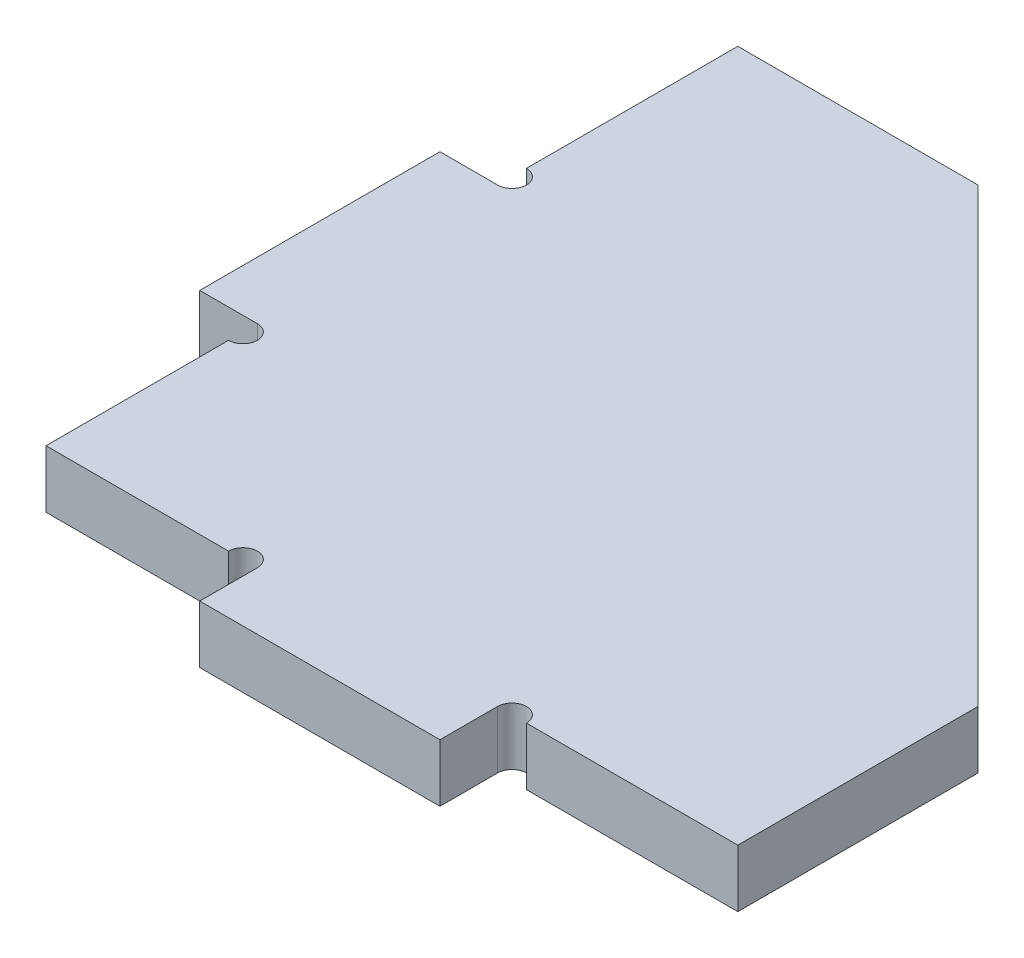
ISO-10303-21;
HEADER;
FILE_DESCRIPTION(('STEP AP214'),'2;1');
FILE_NAME('part.step','',(''),(''),'','','');
FILE_SCHEMA(('AUTOMOTIVE_DESIGN { 1 0 10303 214 1 1 1 1 }'));
ENDSEC;
DATA;
#1=APPLICATION_CONTEXT('core data for automotive mechanical design processes');
#2=APPLICATION_PROTOCOL_DEFINITION('international standard','automotive_design',2000,#1);
#3=PRODUCT_CONTEXT('',#1,'mechanical');
#4=PRODUCT('Part','Part','',(#3));
#5=PRODUCT_RELATED_PRODUCT_CATEGORY('part','',(#4));
#6=PRODUCT_DEFINITION_FORMATION('','',#4);
#7=PRODUCT_DEFINITION_CONTEXT('part definition',#1,'design');
#8=PRODUCT_DEFINITION('design','',#6,#7);
#9=PRODUCT_DEFINITION_SHAPE('','',#8);
#10=(LENGTH_UNIT() NAMED_UNIT(*) SI_UNIT(.MILLI.,.METRE.));
#11=(NAMED_UNIT(*) PLANE_ANGLE_UNIT() SI_UNIT($,.RADIAN.));
#12=(NAMED_UNIT(*) SI_UNIT($,.STERADIAN.) SOLID_ANGLE_UNIT());
#13=UNCERTAINTY_MEASURE_WITH_UNIT(LENGTH_MEASURE(1.E-05),#10,'distance_accuracy_value','');
#14=(GEOMETRIC_REPRESENTATION_CONTEXT(3) GLOBAL_UNCERTAINTY_ASSIGNED_CONTEXT((#13)) GLOBAL_UNIT_ASSIGNED_CONTEXT((#10,
#11,#12)) REPRESENTATION_CONTEXT('',''));
#15=CARTESIAN_POINT('',(0.,0.,0.));
#16=DIRECTION('',(0.,0.,1.));
#17=DIRECTION('',(1.,0.,0.));
#18=AXIS2_PLACEMENT_3D('',#15,#16,#17);
#19=CARTESIAN_POINT('',(0.,12.,-144.));
#20=DIRECTION('',(0.,0.,1.));
#21=DIRECTION('',(1.,0.,0.));
#22=AXIS2_PLACEMENT_3D('',#19,#20,#21);
#23=PLANE('',#22);
#24=DIRECTION('',(-1.,0.,0.));
#25=VECTOR('',#24,1.);
#26=CARTESIAN_POINT('',(0.,0.,-144.));
#27=LINE('',#26,#25);
#28=CARTESIAN_POINT('',(50.,0.,-144.));
#29=VERTEX_POINT('',#28);
#30=CARTESIAN_POINT('',(0.,0.,-144.));
#31=VERTEX_POINT('',#30);
#32=EDGE_CURVE('E187',#29,#31,#27,.T.);
#33=ORIENTED_EDGE('',*,*,#32,.T.);
#34=DIRECTION('',(0.,-1.,0.));
#35=VECTOR('',#34,1.);
#36=CARTESIAN_POINT('',(0.,12.,-144.));
#37=LINE('',#36,#35);
#38=CARTESIAN_POINT('',(0.,12.,-144.));
#39=VERTEX_POINT('',#38);
#40=EDGE_CURVE('E11',#39,#31,#37,.T.);
#41=ORIENTED_EDGE('',*,*,#40,.F.);
#42=DIRECTION('',(-1.,0.,0.));
#43=VECTOR('',#42,1.);
#44=CARTESIAN_POINT('',(0.,12.,-144.));
#45=LINE('',#44,#43);
#46=CARTESIAN_POINT('',(50.,12.,-144.));
#47=VERTEX_POINT('',#46);
#48=EDGE_CURVE('E219',#47,#39,#45,.T.);
#49=ORIENTED_EDGE('',*,*,#48,.F.);
#50=DIRECTION('',(0.,-1.,0.));
#51=VECTOR('',#50,1.);
#52=CARTESIAN_POINT('',(50.,12.,-144.));
#53=LINE('',#52,#51);
#54=EDGE_CURVE('E183',#47,#29,#53,.T.);
#55=ORIENTED_EDGE('',*,*,#54,.T.);
#56=EDGE_LOOP('',(#33,#41,#49,#55));
#57=FACE_BOUND('',#56,.T.);
#58=ADVANCED_FACE('F37',(#57),#23,.F.);
#59=CARTESIAN_POINT('',(0.,12.,-144.));
#60=DIRECTION('',(1.,0.,0.));
#61=DIRECTION('',(0.,0.,-1.));
#62=AXIS2_PLACEMENT_3D('',#59,#60,#61);
#63=PLANE('',#62);
#64=DIRECTION('',(0.,0.,1.));
#65=VECTOR('',#64,1.);
#66=CARTESIAN_POINT('',(0.,0.,-144.));
#67=LINE('',#66,#65);
#68=CARTESIAN_POINT('',(0.,0.,-100.));
#69=VERTEX_POINT('',#68);
#70=EDGE_CURVE('E190',#31,#69,#67,.T.);
#71=ORIENTED_EDGE('',*,*,#70,.T.);
#72=DIRECTION('',(0.,-1.,0.));
#73=VECTOR('',#72,1.);
#74=CARTESIAN_POINT('',(0.,12.,-100.));
#75=LINE('',#74,#73);
#76=CARTESIAN_POINT('',(0.,12.,-100.));
#77=VERTEX_POINT('',#76);
#78=EDGE_CURVE('E45',#77,#69,#75,.T.);
#79=ORIENTED_EDGE('',*,*,#78,.F.);
#80=DIRECTION('',(0.,0.,1.));
#81=VECTOR('',#80,1.);
#82=CARTESIAN_POINT('',(0.,12.,-144.));
#83=LINE('',#82,#81);
#84=EDGE_CURVE('E123',#39,#77,#83,.T.);
#85=ORIENTED_EDGE('',*,*,#84,.F.);
#86=ORIENTED_EDGE('',*,*,#40,.T.);
#87=EDGE_LOOP('',(#71,#79,#85,#86));
#88=FACE_BOUND('',#87,.T.);
#89=ADVANCED_FACE('F322',(#88),#63,.F.);
#90=CARTESIAN_POINT('',(0.,12.,-97.));
#91=DIRECTION('',(0.,-1.,0.));
#92=DIRECTION('',(0.,0.,-1.));
#93=AXIS2_PLACEMENT_3D('',#90,#91,#92);
#94=CYLINDRICAL_SURFACE('',#93,3.);
#95=CARTESIAN_POINT('',(0.,0.,-97.));
#96=DIRECTION('',(0.,-1.,0.));
#97=DIRECTION('',(0.,0.,1.));
#98=AXIS2_PLACEMENT_3D('',#95,#96,#97);
#99=CIRCLE('',#98,3.);
#100=CARTESIAN_POINT('',(0.,0.,-94.));
#101=VERTEX_POINT('',#100);
#102=EDGE_CURVE('E192',#69,#101,#99,.T.);
#103=ORIENTED_EDGE('',*,*,#102,.T.);
#104=DIRECTION('',(0.,-1.,0.));
#105=VECTOR('',#104,1.);
#106=CARTESIAN_POINT('',(0.,12.,-94.));
#107=LINE('',#106,#105);
#108=CARTESIAN_POINT('',(0.,12.,-94.));
#109=VERTEX_POINT('',#108);
#110=EDGE_CURVE('E253',#109,#101,#107,.T.);
#111=ORIENTED_EDGE('',*,*,#110,.F.);
#112=CARTESIAN_POINT('',(0.,12.,-97.));
#113=DIRECTION('',(0.,-1.,0.));
#114=DIRECTION('',(0.,0.,1.));
#115=AXIS2_PLACEMENT_3D('',#112,#113,#114);
#116=CIRCLE('',#115,3.);
#117=EDGE_CURVE('E261',#77,#109,#116,.T.);
#118=ORIENTED_EDGE('',*,*,#117,.F.);
#119=ORIENTED_EDGE('',*,*,#78,.T.);
#120=EDGE_LOOP('',(#103,#111,#118,#119));
#121=FACE_BOUND('',#120,.T.);
#122=ADVANCED_FACE('F259',(#121),#94,.F.);
#123=CARTESIAN_POINT('',(0.,12.,-94.));
#124=DIRECTION('',(0.,0.,1.));
#125=DIRECTION('',(1.,0.,0.));
#126=AXIS2_PLACEMENT_3D('',#123,#124,#125);
#127=PLANE('',#126);
#128=DIRECTION('',(-1.,0.,0.));
#129=VECTOR('',#128,1.);
#130=CARTESIAN_POINT('',(0.,0.,-94.));
#131=LINE('',#130,#129);
#132=CARTESIAN_POINT('',(-12.,0.,-94.));
#133=VERTEX_POINT('',#132);
#134=EDGE_CURVE('E194',#101,#133,#131,.T.);
#135=ORIENTED_EDGE('',*,*,#134,.T.);
#136=DIRECTION('',(0.,-1.,0.));
#137=VECTOR('',#136,1.);
#138=CARTESIAN_POINT('',(-12.,12.,-94.));
#139=LINE('',#138,#137);
#140=CARTESIAN_POINT('',(-12.,12.,-94.));
#141=VERTEX_POINT('',#140);
#142=EDGE_CURVE('E250',#141,#133,#139,.T.);
#143=ORIENTED_EDGE('',*,*,#142,.F.);
#144=DIRECTION('',(-1.,0.,0.));
#145=VECTOR('',#144,1.);
#146=CARTESIAN_POINT('',(0.,12.,-94.));
#147=LINE('',#146,#145);
#148=EDGE_CURVE('E279',#109,#141,#147,.T.);
#149=ORIENTED_EDGE('',*,*,#148,.F.);
#150=ORIENTED_EDGE('',*,*,#110,.T.);
#151=EDGE_LOOP('',(#135,#143,#149,#150));
#152=FACE_BOUND('',#151,.T.);
#153=ADVANCED_FACE('F270',(#152),#127,.F.);
#154=CARTESIAN_POINT('',(-12.,12.,-94.));
#155=DIRECTION('',(1.,0.,0.));
#156=DIRECTION('',(0.,0.,-1.));
#157=AXIS2_PLACEMENT_3D('',#154,#155,#156);
#158=PLANE('',#157);
#159=DIRECTION('',(0.,0.,1.));
#160=VECTOR('',#159,1.);
#161=CARTESIAN_POINT('',(-12.,0.,-94.));
#162=LINE('',#161,#160);
#163=CARTESIAN_POINT('',(-12.,0.,-44.));
#164=VERTEX_POINT('',#163);
#165=EDGE_CURVE('E196',#133,#164,#162,.T.);
#166=ORIENTED_EDGE('',*,*,#165,.T.);
#167=DIRECTION('',(0.,-1.,0.));
#168=VECTOR('',#167,1.);
#169=CARTESIAN_POINT('',(-12.,12.,-44.));
#170=LINE('',#169,#168);
#171=CARTESIAN_POINT('',(-12.,12.,-44.));
#172=VERTEX_POINT('',#171);
#173=EDGE_CURVE('E247',#172,#164,#170,.T.);
#174=ORIENTED_EDGE('',*,*,#173,.F.);
#175=DIRECTION('',(0.,0.,1.));
#176=VECTOR('',#175,1.);
#177=CARTESIAN_POINT('',(-12.,12.,-94.));
#178=LINE('',#177,#176);
#179=EDGE_CURVE('E276',#141,#172,#178,.T.);
#180=ORIENTED_EDGE('',*,*,#179,.F.);
#181=ORIENTED_EDGE('',*,*,#142,.T.);
#182=EDGE_LOOP('',(#166,#174,#180,#181));
#183=FACE_BOUND('',#182,.T.);
#184=ADVANCED_FACE('F274',(#183),#158,.F.);
#185=CARTESIAN_POINT('',(0.,12.,-44.));
#186=DIRECTION('',(0.,0.,-1.));
#187=DIRECTION('',(-1.,0.,0.));
#188=AXIS2_PLACEMENT_3D('',#185,#186,#187);
#189=PLANE('',#188);
#190=DIRECTION('',(1.,0.,0.));
#191=VECTOR('',#190,1.);
#192=CARTESIAN_POINT('',(0.,0.,-44.));
#193=LINE('',#192,#191);
#194=CARTESIAN_POINT('',(0.,0.,-44.));
#195=VERTEX_POINT('',#194);
#196=EDGE_CURVE('E198',#164,#195,#193,.T.);
#197=ORIENTED_EDGE('',*,*,#196,.T.);
#198=DIRECTION('',(0.,-1.,0.));
#199=VECTOR('',#198,1.);
#200=CARTESIAN_POINT('',(0.,12.,-44.));
#201=LINE('',#200,#199);
#202=CARTESIAN_POINT('',(0.,12.,-44.));
#203=VERTEX_POINT('',#202);
#204=EDGE_CURVE('E244',#203,#195,#201,.T.);
#205=ORIENTED_EDGE('',*,*,#204,.F.);
#206=DIRECTION('',(1.,0.,0.));
#207=VECTOR('',#206,1.);
#208=CARTESIAN_POINT('',(0.,12.,-44.));
#209=LINE('',#208,#207);
#210=EDGE_CURVE('E278',#172,#203,#209,.T.);
#211=ORIENTED_EDGE('',*,*,#210,.F.);
#212=ORIENTED_EDGE('',*,*,#173,.T.);
#213=EDGE_LOOP('',(#197,#205,#211,#212));
#214=FACE_BOUND('',#213,.T.);
#215=ADVANCED_FACE('F335',(#214),#189,.F.);
#216=CARTESIAN_POINT('',(0.,12.,-41.));
#217=DIRECTION('',(0.,-1.,0.));
#218=DIRECTION('',(0.,0.,-1.));
#219=AXIS2_PLACEMENT_3D('',#216,#217,#218);
#220=CYLINDRICAL_SURFACE('',#219,3.);
#221=CARTESIAN_POINT('',(0.,0.,-41.));
#222=DIRECTION('',(0.,-1.,0.));
#223=DIRECTION('',(0.,0.,1.));
#224=AXIS2_PLACEMENT_3D('',#221,#222,#223);
#225=CIRCLE('',#224,3.);
#226=CARTESIAN_POINT('',(0.,0.,-38.));
#227=VERTEX_POINT('',#226);
#228=EDGE_CURVE('E200',#195,#227,#225,.T.);
#229=ORIENTED_EDGE('',*,*,#228,.T.);
#230=DIRECTION('',(0.,-1.,0.));
#231=VECTOR('',#230,1.);
#232=CARTESIAN_POINT('',(0.,12.,-38.));
#233=LINE('',#232,#231);
#234=CARTESIAN_POINT('',(0.,12.,-38.));
#235=VERTEX_POINT('',#234);
#236=EDGE_CURVE('E241',#235,#227,#233,.T.);
#237=ORIENTED_EDGE('',*,*,#236,.F.);
#238=CARTESIAN_POINT('',(0.,12.,-41.));
#239=DIRECTION('',(0.,-1.,0.));
#240=DIRECTION('',(0.,0.,1.));
#241=AXIS2_PLACEMENT_3D('',#238,#239,#240);
#242=CIRCLE('',#241,3.);
#243=EDGE_CURVE('E281',#203,#235,#242,.T.);
#244=ORIENTED_EDGE('',*,*,#243,.F.);
#245=ORIENTED_EDGE('',*,*,#204,.T.);
#246=EDGE_LOOP('',(#229,#237,#244,#245));
#247=FACE_BOUND('',#246,.T.);
#248=ADVANCED_FACE('F338',(#247),#220,.F.);
#249=CARTESIAN_POINT('',(0.,12.,-38.));
#250=DIRECTION('',(1.,0.,0.));
#251=DIRECTION('',(0.,0.,-1.));
#252=AXIS2_PLACEMENT_3D('',#249,#250,#251);
#253=PLANE('',#252);
#254=DIRECTION('',(0.,0.,1.));
#255=VECTOR('',#254,1.);
#256=CARTESIAN_POINT('',(0.,0.,-38.));
#257=LINE('',#256,#255);
#258=CARTESIAN_POINT('',(0.,0.,0.));
#259=VERTEX_POINT('',#258);
#260=EDGE_CURVE('E202',#227,#259,#257,.T.);
#261=ORIENTED_EDGE('',*,*,#260,.T.);
#262=DIRECTION('',(0.,-1.,0.));
#263=VECTOR('',#262,1.);
#264=CARTESIAN_POINT('',(0.,12.,0.));
#265=LINE('',#264,#263);
#266=CARTESIAN_POINT('',(0.,12.,0.));
#267=VERTEX_POINT('',#266);
#268=EDGE_CURVE('E238',#267,#259,#265,.T.);
#269=ORIENTED_EDGE('',*,*,#268,.F.);
#270=DIRECTION('',(0.,0.,1.));
#271=VECTOR('',#270,1.);
#272=CARTESIAN_POINT('',(0.,12.,-38.));
#273=LINE('',#272,#271);
#274=EDGE_CURVE('E287',#235,#267,#273,.T.);
#275=ORIENTED_EDGE('',*,*,#274,.F.);
#276=ORIENTED_EDGE('',*,*,#236,.T.);
#277=EDGE_LOOP('',(#261,#269,#275,#276));
#278=FACE_BOUND('',#277,.T.);
#279=ADVANCED_FACE('F342',(#278),#253,.F.);
#280=CARTESIAN_POINT('',(0.,12.,0.));
#281=DIRECTION('',(0.,0.,-1.));
#282=DIRECTION('',(-1.,0.,0.));
#283=AXIS2_PLACEMENT_3D('',#280,#281,#282);
#284=PLANE('',#283);
#285=DIRECTION('',(1.,0.,0.));
#286=VECTOR('',#285,1.);
#287=CARTESIAN_POINT('',(0.,0.,0.));
#288=LINE('',#287,#286);
#289=CARTESIAN_POINT('',(38.,0.,0.));
#290=VERTEX_POINT('',#289);
#291=EDGE_CURVE('E204',#259,#290,#288,.T.);
#292=ORIENTED_EDGE('',*,*,#291,.T.);
#293=DIRECTION('',(0.,-1.,0.));
#294=VECTOR('',#293,1.);
#295=CARTESIAN_POINT('',(38.,12.,0.));
#296=LINE('',#295,#294);
#297=CARTESIAN_POINT('',(38.,12.,0.));
#298=VERTEX_POINT('',#297);
#299=EDGE_CURVE('E235',#298,#290,#296,.T.);
#300=ORIENTED_EDGE('',*,*,#299,.F.);
#301=DIRECTION('',(1.,0.,0.));
#302=VECTOR('',#301,1.);
#303=CARTESIAN_POINT('',(0.,12.,0.));
#304=LINE('',#303,#302);
#305=EDGE_CURVE('E289',#267,#298,#304,.T.);
#306=ORIENTED_EDGE('',*,*,#305,.F.);
#307=ORIENTED_EDGE('',*,*,#268,.T.);
#308=EDGE_LOOP('',(#292,#300,#306,#307));
#309=FACE_BOUND('',#308,.T.);
#310=ADVANCED_FACE('F346',(#309),#284,.F.);
#311=CARTESIAN_POINT('',(41.,12.,0.));
#312=DIRECTION('',(0.,-1.,0.));
#313=DIRECTION('',(0.,0.,-1.));
#314=AXIS2_PLACEMENT_3D('',#311,#312,#313);
#315=CYLINDRICAL_SURFACE('',#314,3.00000000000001);
#316=CARTESIAN_POINT('',(41.,0.,0.));
#317=DIRECTION('',(0.,-1.,0.));
#318=DIRECTION('',(0.,0.,1.));
#319=AXIS2_PLACEMENT_3D('',#316,#317,#318);
#320=CIRCLE('',#319,3.00000000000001);
#321=CARTESIAN_POINT('',(44.,0.,0.));
#322=VERTEX_POINT('',#321);
#323=EDGE_CURVE('E206',#290,#322,#320,.T.);
#324=ORIENTED_EDGE('',*,*,#323,.T.);
#325=DIRECTION('',(0.,-1.,0.));
#326=VECTOR('',#325,1.);
#327=CARTESIAN_POINT('',(44.,12.,0.));
#328=LINE('',#327,#326);
#329=CARTESIAN_POINT('',(44.,12.,0.));
#330=VERTEX_POINT('',#329);
#331=EDGE_CURVE('E232',#330,#322,#328,.T.);
#332=ORIENTED_EDGE('',*,*,#331,.F.);
#333=CARTESIAN_POINT('',(41.,12.,0.));
#334=DIRECTION('',(0.,-1.,0.));
#335=DIRECTION('',(0.,0.,1.));
#336=AXIS2_PLACEMENT_3D('',#333,#334,#335);
#337=CIRCLE('',#336,3.00000000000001);
#338=EDGE_CURVE('E291',#298,#330,#337,.T.);
#339=ORIENTED_EDGE('',*,*,#338,.F.);
#340=ORIENTED_EDGE('',*,*,#299,.T.);
#341=EDGE_LOOP('',(#324,#332,#339,#340));
#342=FACE_BOUND('',#341,.T.);
#343=ADVANCED_FACE('F350',(#342),#315,.F.);
#344=CARTESIAN_POINT('',(44.,12.,0.));
#345=DIRECTION('',(1.,0.,0.));
#346=DIRECTION('',(0.,0.,-1.));
#347=AXIS2_PLACEMENT_3D('',#344,#345,#346);
#348=PLANE('',#347);
#349=DIRECTION('',(0.,0.,1.));
#350=VECTOR('',#349,1.);
#351=CARTESIAN_POINT('',(44.,0.,0.));
#352=LINE('',#351,#350);
#353=CARTESIAN_POINT('',(44.,0.,12.));
#354=VERTEX_POINT('',#353);
#355=EDGE_CURVE('E208',#322,#354,#352,.T.);
#356=ORIENTED_EDGE('',*,*,#355,.T.);
#357=DIRECTION('',(0.,-1.,0.));
#358=VECTOR('',#357,1.);
#359=CARTESIAN_POINT('',(44.,12.,12.));
#360=LINE('',#359,#358);
#361=CARTESIAN_POINT('',(44.,12.,12.));
#362=VERTEX_POINT('',#361);
#363=EDGE_CURVE('E229',#362,#354,#360,.T.);
#364=ORIENTED_EDGE('',*,*,#363,.F.);
#365=DIRECTION('',(0.,0.,1.));
#366=VECTOR('',#365,1.);
#367=CARTESIAN_POINT('',(44.,12.,0.));
#368=LINE('',#367,#366);
#369=EDGE_CURVE('E293',#330,#362,#368,.T.);
#370=ORIENTED_EDGE('',*,*,#369,.F.);
#371=ORIENTED_EDGE('',*,*,#331,.T.);
#372=EDGE_LOOP('',(#356,#364,#370,#371));
#373=FACE_BOUND('',#372,.T.);
#374=ADVANCED_FACE('F354',(#373),#348,.F.);
#375=CARTESIAN_POINT('',(44.,12.,12.));
#376=DIRECTION('',(0.,0.,-1.));
#377=DIRECTION('',(-1.,0.,0.));
#378=AXIS2_PLACEMENT_3D('',#375,#376,#377);
#379=PLANE('',#378);
#380=DIRECTION('',(1.,0.,0.));
#381=VECTOR('',#380,1.);
#382=CARTESIAN_POINT('',(44.,0.,12.));
#383=LINE('',#382,#381);
#384=CARTESIAN_POINT('',(94.,0.,12.));
#385=VERTEX_POINT('',#384);
#386=EDGE_CURVE('E210',#354,#385,#383,.T.);
#387=ORIENTED_EDGE('',*,*,#386,.T.);
#388=DIRECTION('',(0.,-1.,0.));
#389=VECTOR('',#388,1.);
#390=CARTESIAN_POINT('',(94.,12.,12.));
#391=LINE('',#390,#389);
#392=CARTESIAN_POINT('',(94.,12.,12.));
#393=VERTEX_POINT('',#392);
#394=EDGE_CURVE('E226',#393,#385,#391,.T.);
#395=ORIENTED_EDGE('',*,*,#394,.F.);
#396=DIRECTION('',(1.,0.,0.));
#397=VECTOR('',#396,1.);
#398=CARTESIAN_POINT('',(44.,12.,12.));
#399=LINE('',#398,#397);
#400=EDGE_CURVE('E295',#362,#393,#399,.T.);
#401=ORIENTED_EDGE('',*,*,#400,.F.);
#402=ORIENTED_EDGE('',*,*,#363,.T.);
#403=EDGE_LOOP('',(#387,#395,#401,#402));
#404=FACE_BOUND('',#403,.T.);
#405=ADVANCED_FACE('F358',(#404),#379,.F.);
#406=CARTESIAN_POINT('',(94.,12.,0.));
#407=DIRECTION('',(-1.,0.,0.));
#408=DIRECTION('',(0.,0.,1.));
#409=AXIS2_PLACEMENT_3D('',#406,#407,#408);
#410=PLANE('',#409);
#411=DIRECTION('',(0.,0.,-1.));
#412=VECTOR('',#411,1.);
#413=CARTESIAN_POINT('',(94.,0.,0.));
#414=LINE('',#413,#412);
#415=CARTESIAN_POINT('',(94.,0.,0.));
#416=VERTEX_POINT('',#415);
#417=EDGE_CURVE('E212',#385,#416,#414,.T.);
#418=ORIENTED_EDGE('',*,*,#417,.T.);
#419=DIRECTION('',(0.,-1.,0.));
#420=VECTOR('',#419,1.);
#421=CARTESIAN_POINT('',(94.,12.,0.));
#422=LINE('',#421,#420);
#423=CARTESIAN_POINT('',(94.,12.,0.));
#424=VERTEX_POINT('',#423);
#425=EDGE_CURVE('E223',#424,#416,#422,.T.);
#426=ORIENTED_EDGE('',*,*,#425,.F.);
#427=DIRECTION('',(0.,0.,-1.));
#428=VECTOR('',#427,1.);
#429=CARTESIAN_POINT('',(94.,12.,0.));
#430=LINE('',#429,#428);
#431=EDGE_CURVE('E297',#393,#424,#430,.T.);
#432=ORIENTED_EDGE('',*,*,#431,.F.);
#433=ORIENTED_EDGE('',*,*,#394,.T.);
#434=EDGE_LOOP('',(#418,#426,#432,#433));
#435=FACE_BOUND('',#434,.T.);
#436=ADVANCED_FACE('F303',(#435),#410,.F.);
#437=CARTESIAN_POINT('',(97.,12.,0.));
#438=DIRECTION('',(0.,-1.,0.));
#439=DIRECTION('',(0.,0.,-1.));
#440=AXIS2_PLACEMENT_3D('',#437,#438,#439);
#441=CYLINDRICAL_SURFACE('',#440,2.99999999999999);
#442=CARTESIAN_POINT('',(97.,0.,0.));
#443=DIRECTION('',(0.,-1.,0.));
#444=DIRECTION('',(0.,0.,1.));
#445=AXIS2_PLACEMENT_3D('',#442,#443,#444);
#446=CIRCLE('',#445,2.99999999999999);
#447=CARTESIAN_POINT('',(100.,0.,0.));
#448=VERTEX_POINT('',#447);
#449=EDGE_CURVE('E214',#416,#448,#446,.T.);
#450=ORIENTED_EDGE('',*,*,#449,.T.);
#451=DIRECTION('',(0.,-1.,0.));
#452=VECTOR('',#451,1.);
#453=CARTESIAN_POINT('',(100.,12.,0.));
#454=LINE('',#453,#452);
#455=CARTESIAN_POINT('',(100.,12.,0.));
#456=VERTEX_POINT('',#455);
#457=EDGE_CURVE('E178',#456,#448,#454,.T.);
#458=ORIENTED_EDGE('',*,*,#457,.F.);
#459=CARTESIAN_POINT('',(97.,12.,0.));
#460=DIRECTION('',(0.,-1.,0.));
#461=DIRECTION('',(0.,0.,1.));
#462=AXIS2_PLACEMENT_3D('',#459,#460,#461);
#463=CIRCLE('',#462,2.99999999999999);
#464=EDGE_CURVE('E169',#424,#456,#463,.T.);
#465=ORIENTED_EDGE('',*,*,#464,.F.);
#466=ORIENTED_EDGE('',*,*,#425,.T.);
#467=EDGE_LOOP('',(#450,#458,#465,#466));
#468=FACE_BOUND('',#467,.T.);
#469=ADVANCED_FACE('F307',(#468),#441,.F.);
#470=CARTESIAN_POINT('',(100.,12.,0.));
#471=DIRECTION('',(0.,0.,-1.));
#472=DIRECTION('',(-1.,0.,0.));
#473=AXIS2_PLACEMENT_3D('',#470,#471,#472);
#474=PLANE('',#473);
#475=DIRECTION('',(1.,0.,0.));
#476=VECTOR('',#475,1.);
#477=CARTESIAN_POINT('',(100.,0.,0.));
#478=LINE('',#477,#476);
#479=CARTESIAN_POINT('',(144.,0.,0.));
#480=VERTEX_POINT('',#479);
#481=EDGE_CURVE('E177',#448,#480,#478,.T.);
#482=ORIENTED_EDGE('',*,*,#481,.T.);
#483=DIRECTION('',(0.,-1.,0.));
#484=VECTOR('',#483,1.);
#485=CARTESIAN_POINT('',(144.,12.,0.));
#486=LINE('',#485,#484);
#487=CARTESIAN_POINT('',(144.,12.,0.));
#488=VERTEX_POINT('',#487);
#489=EDGE_CURVE('E174',#488,#480,#486,.T.);
#490=ORIENTED_EDGE('',*,*,#489,.F.);
#491=DIRECTION('',(1.,0.,0.));
#492=VECTOR('',#491,1.);
#493=CARTESIAN_POINT('',(100.,12.,0.));
#494=LINE('',#493,#492);
#495=EDGE_CURVE('E163',#456,#488,#494,.T.);
#496=ORIENTED_EDGE('',*,*,#495,.F.);
#497=ORIENTED_EDGE('',*,*,#457,.T.);
#498=EDGE_LOOP('',(#482,#490,#496,#497));
#499=FACE_BOUND('',#498,.T.);
#500=ADVANCED_FACE('F175',(#499),#474,.F.);
#501=CARTESIAN_POINT('',(144.,12.,-50.));
#502=DIRECTION('',(-1.,0.,0.));
#503=DIRECTION('',(0.,0.,1.));
#504=AXIS2_PLACEMENT_3D('',#501,#502,#503);
#505=PLANE('',#504);
#506=DIRECTION('',(0.,0.,-1.));
#507=VECTOR('',#506,1.);
#508=CARTESIAN_POINT('',(144.,0.,-50.));
#509=LINE('',#508,#507);
#510=CARTESIAN_POINT('',(144.,0.,-50.));
#511=VERTEX_POINT('',#510);
#512=EDGE_CURVE('E109',#480,#511,#509,.T.);
#513=ORIENTED_EDGE('',*,*,#512,.T.);
#514=DIRECTION('',(0.,-1.,0.));
#515=VECTOR('',#514,1.);
#516=CARTESIAN_POINT('',(144.,12.,-50.));
#517=LINE('',#516,#515);
#518=CARTESIAN_POINT('',(144.,12.,-50.));
#519=VERTEX_POINT('',#518);
#520=EDGE_CURVE('E179',#519,#511,#517,.T.);
#521=ORIENTED_EDGE('',*,*,#520,.F.);
#522=DIRECTION('',(0.,0.,-1.));
#523=VECTOR('',#522,1.);
#524=CARTESIAN_POINT('',(144.,12.,-50.));
#525=LINE('',#524,#523);
#526=EDGE_CURVE('E167',#488,#519,#525,.T.);
#527=ORIENTED_EDGE('',*,*,#526,.F.);
#528=ORIENTED_EDGE('',*,*,#489,.T.);
#529=EDGE_LOOP('',(#513,#521,#527,#528));
#530=FACE_BOUND('',#529,.T.);
#531=ADVANCED_FACE('F181',(#530),#505,.F.);
#532=CARTESIAN_POINT('',(50.,12.,-144.));
#533=DIRECTION('',(-0.707106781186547,0.,0.707106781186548));
#534=DIRECTION('',(0.707106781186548,0.,0.707106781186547));
#535=AXIS2_PLACEMENT_3D('',#532,#533,#534);
#536=PLANE('',#535);
#537=DIRECTION('',(-0.707106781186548,0.,-0.707106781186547));
#538=VECTOR('',#537,1.);
#539=CARTESIAN_POINT('',(50.,0.,-144.));
#540=LINE('',#539,#538);
#541=EDGE_CURVE('E115',#511,#29,#540,.T.);
#542=ORIENTED_EDGE('',*,*,#541,.T.);
#543=ORIENTED_EDGE('',*,*,#54,.F.);
#544=DIRECTION('',(-0.707106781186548,0.,-0.707106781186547));
#545=VECTOR('',#544,1.);
#546=CARTESIAN_POINT('',(50.,12.,-144.));
#547=LINE('',#546,#545);
#548=EDGE_CURVE('E53',#519,#47,#547,.T.);
#549=ORIENTED_EDGE('',*,*,#548,.F.);
#550=ORIENTED_EDGE('',*,*,#520,.T.);
#551=EDGE_LOOP('',(#542,#543,#549,#550));
#552=FACE_BOUND('',#551,.T.);
#553=ADVANCED_FACE('F311',(#552),#536,.F.);
#554=CARTESIAN_POINT('',(97.,12.,0.));
#555=DIRECTION('',(0.,1.,0.));
#556=DIRECTION('',(0.,0.,1.));
#557=AXIS2_PLACEMENT_3D('',#554,#555,#556);
#558=PLANE('',#557);
#559=ORIENTED_EDGE('',*,*,#48,.T.);
#560=ORIENTED_EDGE('',*,*,#84,.T.);
#561=ORIENTED_EDGE('',*,*,#117,.T.);
#562=ORIENTED_EDGE('',*,*,#148,.T.);
#563=ORIENTED_EDGE('',*,*,#179,.T.);
#564=ORIENTED_EDGE('',*,*,#210,.T.);
#565=ORIENTED_EDGE('',*,*,#243,.T.);
#566=ORIENTED_EDGE('',*,*,#274,.T.);
#567=ORIENTED_EDGE('',*,*,#305,.T.);
#568=ORIENTED_EDGE('',*,*,#338,.T.);
#569=ORIENTED_EDGE('',*,*,#369,.T.);
#570=ORIENTED_EDGE('',*,*,#400,.T.);
#571=ORIENTED_EDGE('',*,*,#431,.T.);
#572=ORIENTED_EDGE('',*,*,#464,.T.);
#573=ORIENTED_EDGE('',*,*,#495,.T.);
#574=ORIENTED_EDGE('',*,*,#526,.T.);
#575=ORIENTED_EDGE('',*,*,#548,.T.);
#576=EDGE_LOOP('',(#559,#560,#561,#562,#563,#564,#565,#566,#567,#568,#569,#570,#571,#572,#573,
#574,#575));
#577=FACE_BOUND('',#576,.T.);
#578=ADVANCED_FACE('F165',(#577),#558,.T.);
#579=CARTESIAN_POINT('',(97.,0.,0.));
#580=DIRECTION('',(0.,1.,0.));
#581=DIRECTION('',(0.,0.,1.));
#582=AXIS2_PLACEMENT_3D('',#579,#580,#581);
#583=PLANE('',#582);
#584=ORIENTED_EDGE('',*,*,#32,.F.);
#585=ORIENTED_EDGE('',*,*,#541,.F.);
#586=ORIENTED_EDGE('',*,*,#512,.F.);
#587=ORIENTED_EDGE('',*,*,#481,.F.);
#588=ORIENTED_EDGE('',*,*,#449,.F.);
#589=ORIENTED_EDGE('',*,*,#417,.F.);
#590=ORIENTED_EDGE('',*,*,#386,.F.);
#591=ORIENTED_EDGE('',*,*,#355,.F.);
#592=ORIENTED_EDGE('',*,*,#323,.F.);
#593=ORIENTED_EDGE('',*,*,#291,.F.);
#594=ORIENTED_EDGE('',*,*,#260,.F.);
#595=ORIENTED_EDGE('',*,*,#228,.F.);
#596=ORIENTED_EDGE('',*,*,#196,.F.);
#597=ORIENTED_EDGE('',*,*,#165,.F.);
#598=ORIENTED_EDGE('',*,*,#134,.F.);
#599=ORIENTED_EDGE('',*,*,#102,.F.);
#600=ORIENTED_EDGE('',*,*,#70,.F.);
#601=EDGE_LOOP('',(#584,#585,#586,#587,#588,#589,#590,#591,#592,#593,#594,#595,#596,#597,#598,
#599,#600));
#602=FACE_BOUND('',#601,.T.);
#603=ADVANCED_FACE('F265',(#602),#583,.F.);
#604=CLOSED_SHELL('',(#58,#89,#122,#153,#184,#215,#248,#279,#310,#343,#374,#405,#436,#469,#500,
#531,#553,#578,#603));
#605=MANIFOLD_SOLID_BREP('B2',#604);
#606=ADVANCED_BREP_SHAPE_REPRESENTATION('',(#18,#605),#14);
#607=SHAPE_DEFINITION_REPRESENTATION(#9,#606);
ENDSEC;
END-ISO-10303-21;
